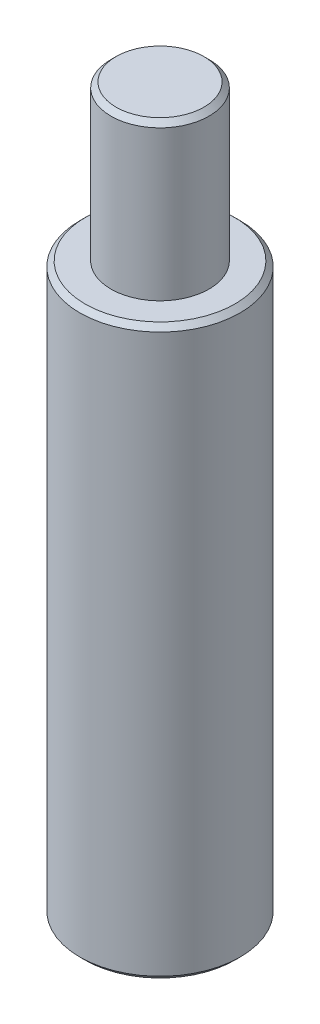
from build123d import *

# Parameters (mm, degrees)
SKETCH1_R                   = 1.55
BOSS_EXTRUDE1_DEPTH         = 11
SKETCH2_R                   = 0.95
BOSS_EXTRUDE2_DEPTH         = 3
TAP_DRILL_FOR_M2_TAP1_D     = 1.6
TAP_DRILL_FOR_M2_TAP1_DEPTH = 8
TAP_DRILL_FOR_M2_TAP1_TIP   = 0.480688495
CHAMFER1_SIZE               = 0.1


with BuildPart() as part:
    # Sketch1 → Boss-Extrude1 (new body)
    with BuildSketch(Plane(origin=(0, 0, 0), x_dir=(1, 0, 0), z_dir=(0, 1, 0))):
        with Locations(Location((0, 0, 0), (0, 0, 270))):
            Circle(SKETCH1_R)
    extrude(amount=BOSS_EXTRUDE1_DEPTH)

    # Sketch2 → Boss-Extrude2 (add)
    with BuildSketch(Plane(origin=(0, 11, 0), x_dir=(1, 0, 0), z_dir=(0, 1, 0))):
        with Locations(Location((0, 0, 0), (0, 0, 270))):
            Circle(SKETCH2_R)
    extrude(amount=BOSS_EXTRUDE2_DEPTH)

    # Tap Drill for M2 Tap1
    with Locations(Plane(origin=(0, 0, 0), x_dir=(-1, 0, 0), z_dir=(0, -1, 0))):
        with Locations((0, 0)):
            Hole(TAP_DRILL_FOR_M2_TAP1_D / 2, depth=TAP_DRILL_FOR_M2_TAP1_DEPTH)
            with Locations((0, 0, -(TAP_DRILL_FOR_M2_TAP1_DEPTH + TAP_DRILL_FOR_M2_TAP1_TIP / 2))):  # 118° drill point
                Cone(0, TAP_DRILL_FOR_M2_TAP1_D / 2, TAP_DRILL_FOR_M2_TAP1_TIP, mode=Mode.SUBTRACT)

    # Chamfer1
    chamfer1_edges = [part.edges().sort_by_distance(p)[0] for p in [
        (0, 0, -1.55),
        (0, 11, -1.55),
        (0, 14, -0.95),
    ]]
    chamfer(chamfer1_edges, length=CHAMFER1_SIZE)


solid = part.part
